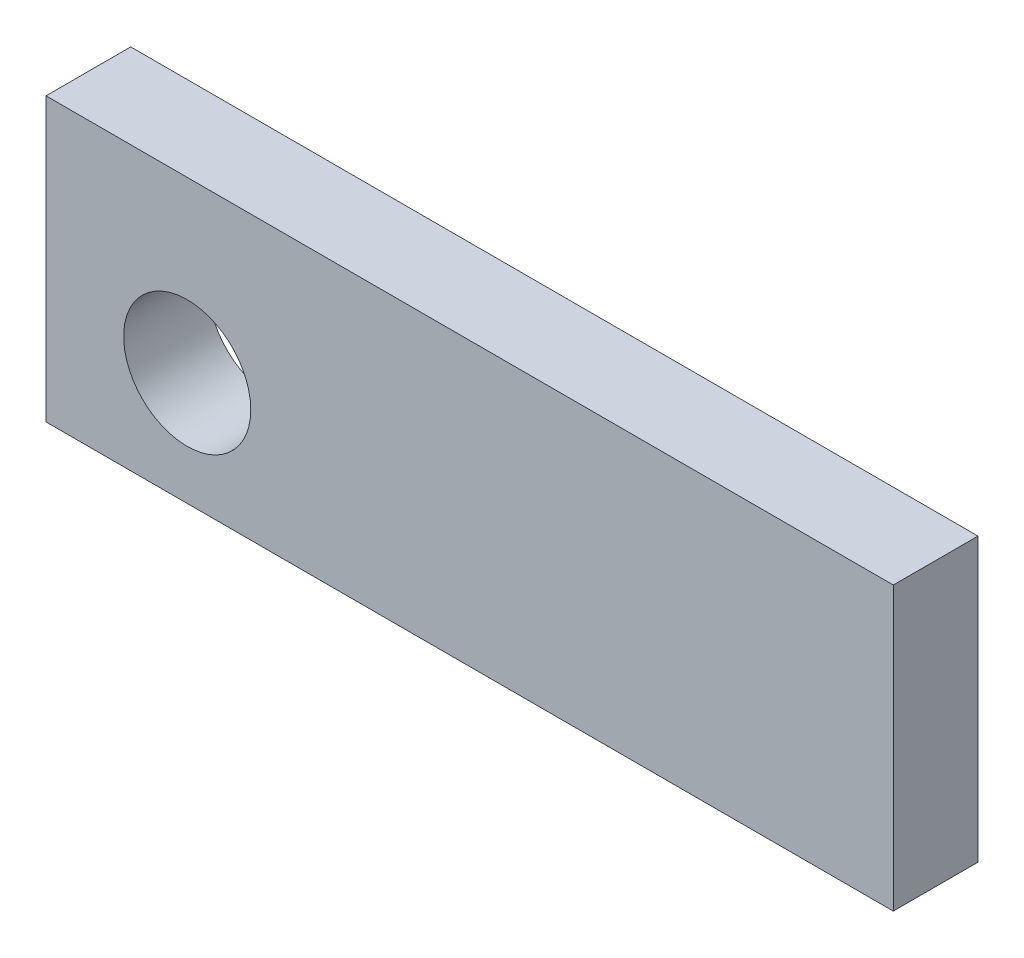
ISO-10303-21;
HEADER;
FILE_DESCRIPTION(('STEP AP214'),'2;1');
FILE_NAME('part.step','',(''),(''),'','','');
FILE_SCHEMA(('AUTOMOTIVE_DESIGN { 1 0 10303 214 1 1 1 1 }'));
ENDSEC;
DATA;
#1=APPLICATION_CONTEXT('core data for automotive mechanical design processes');
#2=APPLICATION_PROTOCOL_DEFINITION('international standard','automotive_design',2000,#1);
#3=PRODUCT_CONTEXT('',#1,'mechanical');
#4=PRODUCT('Part','Part','',(#3));
#5=PRODUCT_RELATED_PRODUCT_CATEGORY('part','',(#4));
#6=PRODUCT_DEFINITION_FORMATION('','',#4);
#7=PRODUCT_DEFINITION_CONTEXT('part definition',#1,'design');
#8=PRODUCT_DEFINITION('design','',#6,#7);
#9=PRODUCT_DEFINITION_SHAPE('','',#8);
#10=(LENGTH_UNIT() NAMED_UNIT(*) SI_UNIT(.MILLI.,.METRE.));
#11=(NAMED_UNIT(*) PLANE_ANGLE_UNIT() SI_UNIT($,.RADIAN.));
#12=(NAMED_UNIT(*) SI_UNIT($,.STERADIAN.) SOLID_ANGLE_UNIT());
#13=UNCERTAINTY_MEASURE_WITH_UNIT(LENGTH_MEASURE(1.E-05),#10,'distance_accuracy_value','');
#14=(GEOMETRIC_REPRESENTATION_CONTEXT(3) GLOBAL_UNCERTAINTY_ASSIGNED_CONTEXT((#13)) GLOBAL_UNIT_ASSIGNED_CONTEXT((#10,
#11,#12)) REPRESENTATION_CONTEXT('',''));
#15=CARTESIAN_POINT('',(0.,0.,0.));
#16=DIRECTION('',(0.,0.,1.));
#17=DIRECTION('',(1.,0.,0.));
#18=AXIS2_PLACEMENT_3D('',#15,#16,#17);
#19=CARTESIAN_POINT('',(0.,0.,0.));
#20=DIRECTION('',(0.,0.,1.));
#21=DIRECTION('',(1.,0.,0.));
#22=AXIS2_PLACEMENT_3D('',#19,#20,#21);
#23=PLANE('',#22);
#24=DIRECTION('',(1.,0.,0.));
#25=VECTOR('',#24,1.);
#26=CARTESIAN_POINT('',(-15.,-5.,0.));
#27=LINE('',#26,#25);
#28=CARTESIAN_POINT('',(15.,-5.,0.));
#29=VERTEX_POINT('',#28);
#30=CARTESIAN_POINT('',(-15.,-5.,0.));
#31=VERTEX_POINT('',#30);
#32=EDGE_CURVE('E84',#29,#31,#27,.F.);
#33=ORIENTED_EDGE('',*,*,#32,.T.);
#34=DIRECTION('',(0.,1.,0.));
#35=VECTOR('',#34,1.);
#36=CARTESIAN_POINT('',(-15.,5.,0.));
#37=LINE('',#36,#35);
#38=CARTESIAN_POINT('',(-15.,5.,0.));
#39=VERTEX_POINT('',#38);
#40=EDGE_CURVE('E71',#31,#39,#37,.T.);
#41=ORIENTED_EDGE('',*,*,#40,.T.);
#42=DIRECTION('',(1.,0.,0.));
#43=VECTOR('',#42,1.);
#44=CARTESIAN_POINT('',(-15.,5.,0.));
#45=LINE('',#44,#43);
#46=CARTESIAN_POINT('',(15.,5.,0.));
#47=VERTEX_POINT('',#46);
#48=EDGE_CURVE('E55',#39,#47,#45,.T.);
#49=ORIENTED_EDGE('',*,*,#48,.T.);
#50=DIRECTION('',(0.,1.,0.));
#51=VECTOR('',#50,1.);
#52=CARTESIAN_POINT('',(15.,5.,0.));
#53=LINE('',#52,#51);
#54=EDGE_CURVE('E60',#47,#29,#53,.F.);
#55=ORIENTED_EDGE('',*,*,#54,.T.);
#56=EDGE_LOOP('',(#33,#41,#49,#55));
#57=FACE_BOUND('',#56,.T.);
#58=CARTESIAN_POINT('',(-10.,-0.999999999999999,0.));
#59=DIRECTION('',(0.,0.,1.));
#60=DIRECTION('',(1.,0.,0.));
#61=AXIS2_PLACEMENT_3D('',#58,#59,#60);
#62=CIRCLE('',#61,2.25);
#63=CARTESIAN_POINT('',(-7.75,-0.999999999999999,0.));
#64=VERTEX_POINT('',#63);
#65=EDGE_CURVE('E20',#64,#64,#62,.T.);
#66=ORIENTED_EDGE('',*,*,#65,.T.);
#67=EDGE_LOOP('',(#66));
#68=FACE_BOUND('',#67,.T.);
#69=ADVANCED_FACE('F17',(#57,#68),#23,.F.);
#70=CARTESIAN_POINT('',(-10.,-0.999999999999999,0.));
#71=DIRECTION('',(0.,0.,1.));
#72=DIRECTION('',(1.,0.,0.));
#73=AXIS2_PLACEMENT_3D('',#70,#71,#72);
#74=CYLINDRICAL_SURFACE('',#73,2.25);
#75=CARTESIAN_POINT('',(-10.,-0.999999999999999,3.));
#76=DIRECTION('',(0.,0.,1.));
#77=DIRECTION('',(1.,0.,0.));
#78=AXIS2_PLACEMENT_3D('',#75,#76,#77);
#79=CIRCLE('',#78,2.25);
#80=CARTESIAN_POINT('',(-7.75,-0.999999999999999,3.));
#81=VERTEX_POINT('',#80);
#82=EDGE_CURVE('E81',#81,#81,#79,.F.);
#83=ORIENTED_EDGE('',*,*,#82,.F.);
#84=EDGE_LOOP('',(#83));
#85=FACE_BOUND('',#84,.T.);
#86=ORIENTED_EDGE('',*,*,#65,.F.);
#87=EDGE_LOOP('',(#86));
#88=FACE_BOUND('',#87,.T.);
#89=ADVANCED_FACE('F113',(#85,#88),#74,.F.);
#90=CARTESIAN_POINT('',(15.,5.,3.));
#91=DIRECTION('',(-1.,0.,0.));
#92=DIRECTION('',(0.,0.,1.));
#93=AXIS2_PLACEMENT_3D('',#90,#91,#92);
#94=PLANE('',#93);
#95=DIRECTION('',(0.,0.,-1.));
#96=VECTOR('',#95,1.);
#97=CARTESIAN_POINT('',(15.,5.,3.));
#98=LINE('',#97,#96);
#99=CARTESIAN_POINT('',(15.,5.,3.));
#100=VERTEX_POINT('',#99);
#101=EDGE_CURVE('E62',#47,#100,#98,.F.);
#102=ORIENTED_EDGE('',*,*,#101,.T.);
#103=DIRECTION('',(0.,1.,0.));
#104=VECTOR('',#103,1.);
#105=CARTESIAN_POINT('',(15.,0.,3.));
#106=LINE('',#105,#104);
#107=CARTESIAN_POINT('',(15.,-5.,3.));
#108=VERTEX_POINT('',#107);
#109=EDGE_CURVE('E83',#108,#100,#106,.T.);
#110=ORIENTED_EDGE('',*,*,#109,.F.);
#111=DIRECTION('',(0.,0.,1.));
#112=VECTOR('',#111,1.);
#113=CARTESIAN_POINT('',(15.,-5.,3.));
#114=LINE('',#113,#112);
#115=EDGE_CURVE('E65',#108,#29,#114,.F.);
#116=ORIENTED_EDGE('',*,*,#115,.T.);
#117=ORIENTED_EDGE('',*,*,#54,.F.);
#118=EDGE_LOOP('',(#102,#110,#116,#117));
#119=FACE_BOUND('',#118,.T.);
#120=ADVANCED_FACE('F61',(#119),#94,.F.);
#121=CARTESIAN_POINT('',(-15.,5.,3.));
#122=DIRECTION('',(0.,-1.,0.));
#123=DIRECTION('',(0.,0.,-1.));
#124=AXIS2_PLACEMENT_3D('',#121,#122,#123);
#125=PLANE('',#124);
#126=DIRECTION('',(0.,0.,-1.));
#127=VECTOR('',#126,1.);
#128=CARTESIAN_POINT('',(-15.,5.,3.));
#129=LINE('',#128,#127);
#130=CARTESIAN_POINT('',(-15.,5.,3.));
#131=VERTEX_POINT('',#130);
#132=EDGE_CURVE('E73',#39,#131,#129,.F.);
#133=ORIENTED_EDGE('',*,*,#132,.T.);
#134=DIRECTION('',(1.,0.,0.));
#135=VECTOR('',#134,1.);
#136=CARTESIAN_POINT('',(0.,5.,3.));
#137=LINE('',#136,#135);
#138=EDGE_CURVE('E77',#100,#131,#137,.F.);
#139=ORIENTED_EDGE('',*,*,#138,.F.);
#140=ORIENTED_EDGE('',*,*,#101,.F.);
#141=ORIENTED_EDGE('',*,*,#48,.F.);
#142=EDGE_LOOP('',(#133,#139,#140,#141));
#143=FACE_BOUND('',#142,.T.);
#144=ADVANCED_FACE('F75',(#143),#125,.F.);
#145=CARTESIAN_POINT('',(-15.,5.,3.));
#146=DIRECTION('',(1.,0.,0.));
#147=DIRECTION('',(0.,0.,-1.));
#148=AXIS2_PLACEMENT_3D('',#145,#146,#147);
#149=PLANE('',#148);
#150=DIRECTION('',(0.,0.,1.));
#151=VECTOR('',#150,1.);
#152=CARTESIAN_POINT('',(-15.,-5.,3.));
#153=LINE('',#152,#151);
#154=CARTESIAN_POINT('',(-15.,-5.,3.));
#155=VERTEX_POINT('',#154);
#156=EDGE_CURVE('E35',#31,#155,#153,.T.);
#157=ORIENTED_EDGE('',*,*,#156,.T.);
#158=DIRECTION('',(0.,1.,0.));
#159=VECTOR('',#158,1.);
#160=CARTESIAN_POINT('',(-15.,0.,3.));
#161=LINE('',#160,#159);
#162=EDGE_CURVE('E26',#131,#155,#161,.F.);
#163=ORIENTED_EDGE('',*,*,#162,.F.);
#164=ORIENTED_EDGE('',*,*,#132,.F.);
#165=ORIENTED_EDGE('',*,*,#40,.F.);
#166=EDGE_LOOP('',(#157,#163,#164,#165));
#167=FACE_BOUND('',#166,.T.);
#168=ADVANCED_FACE('F94',(#167),#149,.F.);
#169=CARTESIAN_POINT('',(-15.,-5.,3.));
#170=DIRECTION('',(0.,1.,0.));
#171=DIRECTION('',(0.,0.,1.));
#172=AXIS2_PLACEMENT_3D('',#169,#170,#171);
#173=PLANE('',#172);
#174=ORIENTED_EDGE('',*,*,#115,.F.);
#175=DIRECTION('',(1.,0.,0.));
#176=VECTOR('',#175,1.);
#177=CARTESIAN_POINT('',(0.,-5.,3.));
#178=LINE('',#177,#176);
#179=EDGE_CURVE('E11',#155,#108,#178,.T.);
#180=ORIENTED_EDGE('',*,*,#179,.F.);
#181=ORIENTED_EDGE('',*,*,#156,.F.);
#182=ORIENTED_EDGE('',*,*,#32,.F.);
#183=EDGE_LOOP('',(#174,#180,#181,#182));
#184=FACE_BOUND('',#183,.T.);
#185=ADVANCED_FACE('F99',(#184),#173,.F.);
#186=CARTESIAN_POINT('',(0.,0.,3.));
#187=DIRECTION('',(0.,0.,1.));
#188=DIRECTION('',(1.,0.,0.));
#189=AXIS2_PLACEMENT_3D('',#186,#187,#188);
#190=PLANE('',#189);
#191=ORIENTED_EDGE('',*,*,#162,.T.);
#192=ORIENTED_EDGE('',*,*,#179,.T.);
#193=ORIENTED_EDGE('',*,*,#109,.T.);
#194=ORIENTED_EDGE('',*,*,#138,.T.);
#195=EDGE_LOOP('',(#191,#192,#193,#194));
#196=FACE_BOUND('',#195,.T.);
#197=ORIENTED_EDGE('',*,*,#82,.T.);
#198=EDGE_LOOP('',(#197));
#199=FACE_BOUND('',#198,.T.);
#200=ADVANCED_FACE('F97',(#196,#199),#190,.T.);
#201=CLOSED_SHELL('',(#69,#89,#120,#144,#168,#185,#200));
#202=MANIFOLD_SOLID_BREP('B1',#201);
#203=ADVANCED_BREP_SHAPE_REPRESENTATION('',(#18,#202),#14);
#204=SHAPE_DEFINITION_REPRESENTATION(#9,#203);
ENDSEC;
END-ISO-10303-21;
